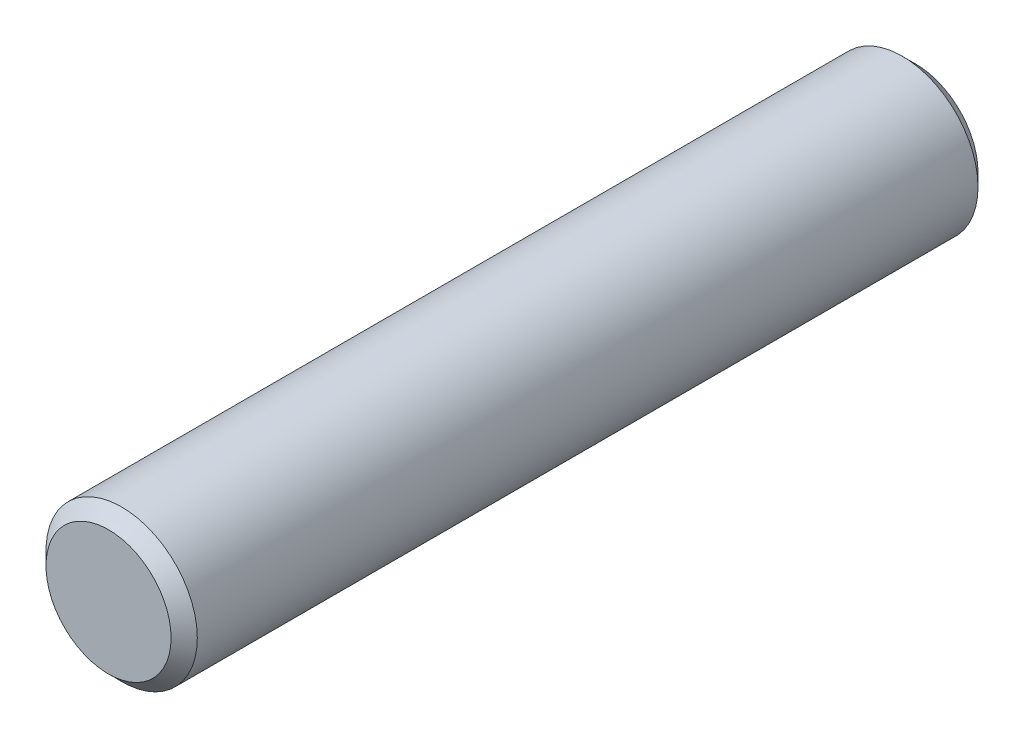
from build123d import *

# Parameters (mm, degrees)
SKETCH1_R      = 4.7625
EXTRUDE1_DEPTH = 25.4
CHAMFER1_SIZE  = 0.8255


with BuildPart() as part:
    # Sketch1 → Extrude1 (new, symmetric)
    with BuildSketch(Plane.XY):
        Circle(SKETCH1_R)
    extrude(amount=EXTRUDE1_DEPTH, both=True)

    # Chamfer1
    chamfer1_edges = [part.edges().sort_by_distance(p)[0] for p in [
        (-4.7625, 0, -25.4),
        (-4.7625, 0, 25.4),
    ]]
    chamfer(chamfer1_edges, length=CHAMFER1_SIZE)


solid = part.part
